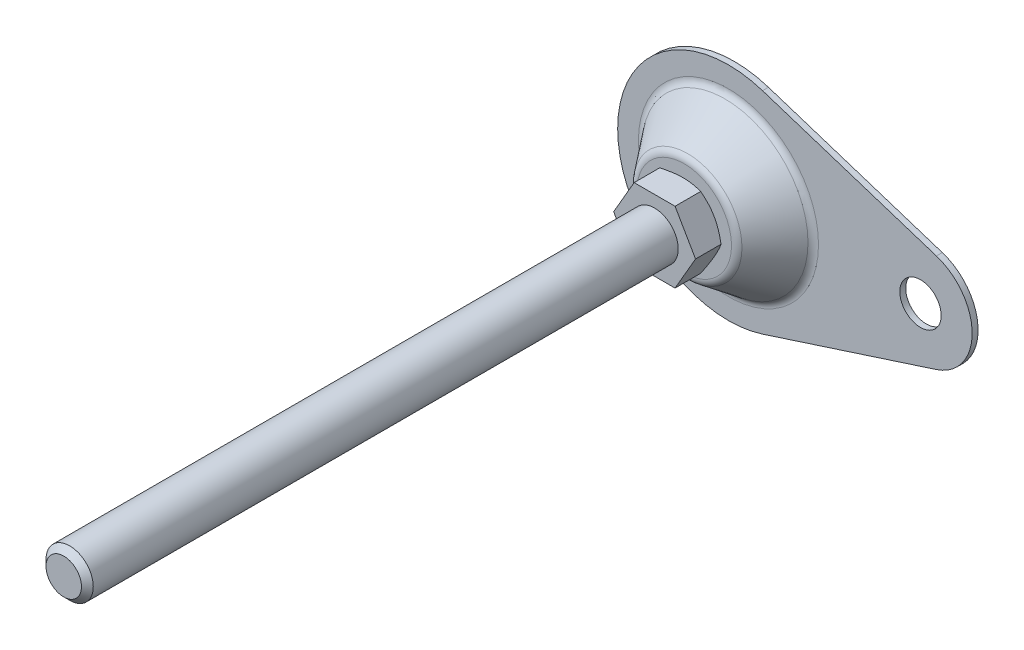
ISO-10303-21;
HEADER;
FILE_DESCRIPTION(('STEP AP214'),'2;1');
FILE_NAME('part.step','',(''),(''),'','','');
FILE_SCHEMA(('AUTOMOTIVE_DESIGN { 1 0 10303 214 1 1 1 1 }'));
ENDSEC;
DATA;
#1=APPLICATION_CONTEXT('core data for automotive mechanical design processes');
#2=APPLICATION_PROTOCOL_DEFINITION('international standard','automotive_design',2000,#1);
#3=PRODUCT_CONTEXT('',#1,'mechanical');
#4=PRODUCT('Part','Part','',(#3));
#5=PRODUCT_RELATED_PRODUCT_CATEGORY('part','',(#4));
#6=PRODUCT_DEFINITION_FORMATION('','',#4);
#7=PRODUCT_DEFINITION_CONTEXT('part definition',#1,'design');
#8=PRODUCT_DEFINITION('design','',#6,#7);
#9=PRODUCT_DEFINITION_SHAPE('','',#8);
#10=(LENGTH_UNIT() NAMED_UNIT(*) SI_UNIT(.MILLI.,.METRE.));
#11=(NAMED_UNIT(*) PLANE_ANGLE_UNIT() SI_UNIT($,.RADIAN.));
#12=(NAMED_UNIT(*) SI_UNIT($,.STERADIAN.) SOLID_ANGLE_UNIT());
#13=UNCERTAINTY_MEASURE_WITH_UNIT(LENGTH_MEASURE(1.E-05),#10,'distance_accuracy_value','');
#14=(GEOMETRIC_REPRESENTATION_CONTEXT(3) GLOBAL_UNCERTAINTY_ASSIGNED_CONTEXT((#13)) GLOBAL_UNIT_ASSIGNED_CONTEXT((#10,
#11,#12)) REPRESENTATION_CONTEXT('',''));
#15=CARTESIAN_POINT('',(0.,0.,0.));
#16=DIRECTION('',(0.,0.,1.));
#17=DIRECTION('',(1.,0.,0.));
#18=AXIS2_PLACEMENT_3D('',#15,#16,#17);
#19=CARTESIAN_POINT('',(65.,0.,2.));
#20=DIRECTION('',(0.,0.,1.));
#21=DIRECTION('',(1.,0.,0.));
#22=AXIS2_PLACEMENT_3D('',#19,#20,#21);
#23=PLANE('',#22);
#24=CARTESIAN_POINT('',(0.,0.,2.));
#25=DIRECTION('',(0.,0.,1.));
#26=DIRECTION('',(1.,0.,0.));
#27=AXIS2_PLACEMENT_3D('',#24,#25,#26);
#28=CIRCLE('',#27,30.4802116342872);
#29=CARTESIAN_POINT('',(30.4802116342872,0.,2.));
#30=VERTEX_POINT('',#29);
#31=EDGE_CURVE('E245',#30,#30,#28,.F.);
#32=ORIENTED_EDGE('',*,*,#31,.T.);
#33=EDGE_LOOP('',(#32));
#34=FACE_BOUND('',#33,.T.);
#35=CARTESIAN_POINT('',(65.,0.,2.));
#36=DIRECTION('',(0.,0.,1.));
#37=DIRECTION('',(1.,0.,0.));
#38=AXIS2_PLACEMENT_3D('',#35,#36,#37);
#39=CIRCLE('',#38,7.);
#40=CARTESIAN_POINT('',(72.,0.,2.));
#41=VERTEX_POINT('',#40);
#42=EDGE_CURVE('E262',#41,#41,#39,.T.);
#43=ORIENTED_EDGE('',*,*,#42,.F.);
#44=EDGE_LOOP('',(#43));
#45=FACE_BOUND('',#44,.T.);
#46=DIRECTION('',(-0.951485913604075,0.307692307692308,0.));
#47=VECTOR('',#46,1.);
#48=CARTESIAN_POINT('',(11.5384615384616,35.6807217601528,2.));
#49=LINE('',#48,#47);
#50=CARTESIAN_POINT('',(70.3846153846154,16.6510034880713,2.));
#51=VERTEX_POINT('',#50);
#52=CARTESIAN_POINT('',(11.5384615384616,35.6807217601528,2.));
#53=VERTEX_POINT('',#52);
#54=EDGE_CURVE('E112',#51,#53,#49,.T.);
#55=ORIENTED_EDGE('',*,*,#54,.T.);
#56=CARTESIAN_POINT('',(0.,0.,2.));
#57=DIRECTION('',(0.,0.,1.));
#58=DIRECTION('',(1.,0.,0.));
#59=AXIS2_PLACEMENT_3D('',#56,#57,#58);
#60=CIRCLE('',#59,37.5);
#61=CARTESIAN_POINT('',(11.5384615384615,-35.6807217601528,2.));
#62=VERTEX_POINT('',#61);
#63=EDGE_CURVE('E114',#53,#62,#60,.T.);
#64=ORIENTED_EDGE('',*,*,#63,.T.);
#65=DIRECTION('',(0.951485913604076,0.307692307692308,0.));
#66=VECTOR('',#65,1.);
#67=CARTESIAN_POINT('',(11.5384615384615,-35.6807217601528,2.));
#68=LINE('',#67,#66);
#69=CARTESIAN_POINT('',(70.3846153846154,-16.6510034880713,2.));
#70=VERTEX_POINT('',#69);
#71=EDGE_CURVE('E97',#62,#70,#68,.T.);
#72=ORIENTED_EDGE('',*,*,#71,.T.);
#73=CARTESIAN_POINT('',(65.,0.,2.));
#74=DIRECTION('',(0.,0.,1.));
#75=DIRECTION('',(1.,0.,0.));
#76=AXIS2_PLACEMENT_3D('',#73,#74,#75);
#77=CIRCLE('',#76,17.5);
#78=EDGE_CURVE('E106',#70,#51,#77,.T.);
#79=ORIENTED_EDGE('',*,*,#78,.T.);
#80=EDGE_LOOP('',(#55,#64,#72,#79));
#81=FACE_BOUND('',#80,.T.);
#82=ADVANCED_FACE('F14',(#34,#45,#81),#23,.T.);
#83=CARTESIAN_POINT('',(65.,0.,0.));
#84=DIRECTION('',(0.,0.,1.));
#85=DIRECTION('',(1.,0.,0.));
#86=AXIS2_PLACEMENT_3D('',#83,#84,#85);
#87=PLANE('',#86);
#88=CARTESIAN_POINT('',(65.,0.,0.));
#89=DIRECTION('',(0.,0.,1.));
#90=DIRECTION('',(1.,0.,0.));
#91=AXIS2_PLACEMENT_3D('',#88,#89,#90);
#92=CIRCLE('',#91,7.);
#93=CARTESIAN_POINT('',(72.,0.,0.));
#94=VERTEX_POINT('',#93);
#95=EDGE_CURVE('E258',#94,#94,#92,.T.);
#96=ORIENTED_EDGE('',*,*,#95,.T.);
#97=EDGE_LOOP('',(#96));
#98=FACE_BOUND('',#97,.T.);
#99=CARTESIAN_POINT('',(0.,0.,0.));
#100=DIRECTION('',(0.,0.,1.));
#101=DIRECTION('',(1.,0.,0.));
#102=AXIS2_PLACEMENT_3D('',#99,#100,#101);
#103=CIRCLE('',#102,37.5);
#104=CARTESIAN_POINT('',(11.5384615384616,35.6807217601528,0.));
#105=VERTEX_POINT('',#104);
#106=CARTESIAN_POINT('',(11.5384615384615,-35.6807217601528,0.));
#107=VERTEX_POINT('',#106);
#108=EDGE_CURVE('E275',#105,#107,#103,.T.);
#109=ORIENTED_EDGE('',*,*,#108,.F.);
#110=DIRECTION('',(-0.951485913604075,0.307692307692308,0.));
#111=VECTOR('',#110,1.);
#112=CARTESIAN_POINT('',(70.3846153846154,16.6510034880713,0.));
#113=LINE('',#112,#111);
#114=CARTESIAN_POINT('',(70.3846153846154,16.6510034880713,0.));
#115=VERTEX_POINT('',#114);
#116=EDGE_CURVE('E9',#115,#105,#113,.T.);
#117=ORIENTED_EDGE('',*,*,#116,.F.);
#118=CARTESIAN_POINT('',(65.,0.,0.));
#119=DIRECTION('',(0.,0.,1.));
#120=DIRECTION('',(1.,0.,0.));
#121=AXIS2_PLACEMENT_3D('',#118,#119,#120);
#122=CIRCLE('',#121,17.5);
#123=CARTESIAN_POINT('',(70.3846153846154,-16.6510034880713,0.));
#124=VERTEX_POINT('',#123);
#125=EDGE_CURVE('E22',#124,#115,#122,.T.);
#126=ORIENTED_EDGE('',*,*,#125,.F.);
#127=DIRECTION('',(0.951485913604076,0.307692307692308,0.));
#128=VECTOR('',#127,1.);
#129=CARTESIAN_POINT('',(70.3846153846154,-16.6510034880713,0.));
#130=LINE('',#129,#128);
#131=EDGE_CURVE('E99',#107,#124,#130,.T.);
#132=ORIENTED_EDGE('',*,*,#131,.F.);
#133=EDGE_LOOP('',(#109,#117,#126,#132));
#134=FACE_BOUND('',#133,.T.);
#135=ADVANCED_FACE('F215',(#98,#134),#87,.F.);
#136=CARTESIAN_POINT('',(0.,0.,17.));
#137=DIRECTION('',(0.,0.,-1.));
#138=DIRECTION('',(-1.,0.,0.));
#139=AXIS2_PLACEMENT_3D('',#136,#137,#138);
#140=PLANE('',#139);
#141=CARTESIAN_POINT('',(0.,0.,17.));
#142=DIRECTION('',(0.,0.,-1.));
#143=DIRECTION('',(-1.,0.,0.));
#144=AXIS2_PLACEMENT_3D('',#141,#142,#143);
#145=CIRCLE('',#144,16.0197883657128);
#146=CARTESIAN_POINT('',(-16.0197883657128,0.,17.));
#147=VERTEX_POINT('',#146);
#148=EDGE_CURVE('E278',#147,#147,#145,.F.);
#149=ORIENTED_EDGE('',*,*,#148,.T.);
#150=EDGE_LOOP('',(#149));
#151=FACE_BOUND('',#150,.T.);
#152=CARTESIAN_POINT('',(0.,0.,17.));
#153=DIRECTION('',(0.,0.,-1.));
#154=DIRECTION('',(-1.,0.,0.));
#155=AXIS2_PLACEMENT_3D('',#152,#153,#154);
#156=CIRCLE('',#155,11.5);
#157=CARTESIAN_POINT('',(-11.5,0.,17.));
#158=VERTEX_POINT('',#157);
#159=EDGE_CURVE('E122',#158,#158,#156,.T.);
#160=ORIENTED_EDGE('',*,*,#159,.T.);
#161=EDGE_LOOP('',(#160));
#162=FACE_BOUND('',#161,.T.);
#163=ADVANCED_FACE('F211',(#151,#162),#140,.F.);
#164=CARTESIAN_POINT('',(0.,0.,5.));
#165=DIRECTION('',(0.,0.,1.));
#166=DIRECTION('',(1.,0.,0.));
#167=AXIS2_PLACEMENT_3D('',#164,#165,#166);
#168=TOROIDAL_SURFACE('',#167,30.4802116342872,3.);
#169=CARTESIAN_POINT('',(0.,0.,3.1747053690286));
#170=DIRECTION('',(0.,0.,1.));
#171=DIRECTION('',(1.,0.,0.));
#172=AXIS2_PLACEMENT_3D('',#169,#170,#171);
#173=CIRCLE('',#172,28.0993925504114);
#174=CARTESIAN_POINT('',(28.0993925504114,0.,3.1747053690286));
#175=VERTEX_POINT('',#174);
#176=EDGE_CURVE('E242',#175,#175,#173,.T.);
#177=ORIENTED_EDGE('',*,*,#176,.F.);
#178=EDGE_LOOP('',(#177));
#179=FACE_BOUND('',#178,.T.);
#180=ORIENTED_EDGE('',*,*,#31,.F.);
#181=EDGE_LOOP('',(#180));
#182=FACE_BOUND('',#181,.T.);
#183=ADVANCED_FACE('F214',(#179,#182),#168,.F.);
#184=CARTESIAN_POINT('',(0.,0.,14.));
#185=DIRECTION('',(0.,0.,-1.));
#186=DIRECTION('',(-1.,0.,0.));
#187=AXIS2_PLACEMENT_3D('',#184,#185,#186);
#188=TOROIDAL_SURFACE('',#187,16.0197883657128,3.);
#189=ORIENTED_EDGE('',*,*,#148,.F.);
#190=EDGE_LOOP('',(#189));
#191=FACE_BOUND('',#190,.T.);
#192=CARTESIAN_POINT('',(0.,0.,15.8252946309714));
#193=DIRECTION('',(0.,0.,1.));
#194=DIRECTION('',(1.,0.,0.));
#195=AXIS2_PLACEMENT_3D('',#192,#193,#194);
#196=CIRCLE('',#195,18.4006074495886);
#197=CARTESIAN_POINT('',(18.4006074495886,0.,15.8252946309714));
#198=VERTEX_POINT('',#197);
#199=EDGE_CURVE('E251',#198,#198,#196,.F.);
#200=ORIENTED_EDGE('',*,*,#199,.F.);
#201=EDGE_LOOP('',(#200));
#202=FACE_BOUND('',#201,.T.);
#203=ADVANCED_FACE('F229',(#191,#202),#188,.T.);
#204=CARTESIAN_POINT('',(0.,0.,2.));
#205=DIRECTION('',(0.,0.,-1.));
#206=DIRECTION('',(-1.,0.,0.));
#207=AXIS2_PLACEMENT_3D('',#204,#205,#206);
#208=CYLINDRICAL_SURFACE('',#207,37.5);
#209=ORIENTED_EDGE('',*,*,#108,.T.);
#210=DIRECTION('',(0.,0.,1.));
#211=VECTOR('',#210,1.);
#212=CARTESIAN_POINT('',(11.5384615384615,-35.6807217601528,-8.));
#213=LINE('',#212,#211);
#214=EDGE_CURVE('E103',#107,#62,#213,.T.);
#215=ORIENTED_EDGE('',*,*,#214,.T.);
#216=ORIENTED_EDGE('',*,*,#63,.F.);
#217=DIRECTION('',(0.,0.,1.));
#218=VECTOR('',#217,1.);
#219=CARTESIAN_POINT('',(11.5384615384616,35.6807217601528,-8.));
#220=LINE('',#219,#218);
#221=EDGE_CURVE('E119',#105,#53,#220,.T.);
#222=ORIENTED_EDGE('',*,*,#221,.F.);
#223=EDGE_LOOP('',(#209,#215,#216,#222));
#224=FACE_BOUND('',#223,.T.);
#225=ADVANCED_FACE('F219',(#224),#208,.T.);
#226=CARTESIAN_POINT('',(65.,0.,2.));
#227=DIRECTION('',(0.,0.,-1.));
#228=DIRECTION('',(-1.,0.,0.));
#229=AXIS2_PLACEMENT_3D('',#226,#227,#228);
#230=CYLINDRICAL_SURFACE('',#229,7.);
#231=ORIENTED_EDGE('',*,*,#42,.T.);
#232=EDGE_LOOP('',(#231));
#233=FACE_BOUND('',#232,.T.);
#234=ORIENTED_EDGE('',*,*,#95,.F.);
#235=EDGE_LOOP('',(#234));
#236=FACE_BOUND('',#235,.T.);
#237=ADVANCED_FACE('F209',(#233,#236),#230,.F.);
#238=CARTESIAN_POINT('',(0.,0.,2.));
#239=DIRECTION('',(0.,0.,-1.));
#240=DIRECTION('',(-1.,0.,0.));
#241=AXIS2_PLACEMENT_3D('',#238,#239,#240);
#242=CONICAL_SURFACE('',#241,29.,0.654082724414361);
#243=ORIENTED_EDGE('',*,*,#176,.T.);
#244=EDGE_LOOP('',(#243));
#245=FACE_BOUND('',#244,.T.);
#246=ORIENTED_EDGE('',*,*,#199,.T.);
#247=EDGE_LOOP('',(#246));
#248=FACE_BOUND('',#247,.T.);
#249=ADVANCED_FACE('F151',(#245,#248),#242,.T.);
#250=CARTESIAN_POINT('',(0.,0.,17.));
#251=DIRECTION('',(0.,0.,1.));
#252=DIRECTION('',(1.,0.,0.));
#253=AXIS2_PLACEMENT_3D('',#250,#251,#252);
#254=CONICAL_SURFACE('',#253,11.5,1.0471975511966);
#255=ORIENTED_EDGE('',*,*,#159,.F.);
#256=EDGE_LOOP('',(#255));
#257=FACE_BOUND('',#256,.T.);
#258=CARTESIAN_POINT('',(13.8565219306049,0.000200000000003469,18.3605385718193));
#259=CARTESIAN_POINT('',(13.7042251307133,-0.263585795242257,18.2726247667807));
#260=CARTESIAN_POINT('',(13.5513604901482,-0.528355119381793,18.1887011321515));
#261=CARTESIAN_POINT('',(13.244405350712,-1.06001701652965,18.0299413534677));
#262=CARTESIAN_POINT('',(13.0903144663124,-1.32691025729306,17.9551081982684));
#263=CARTESIAN_POINT('',(12.6255589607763,-2.131890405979,17.745692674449));
#264=CARTESIAN_POINT('',(12.3130596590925,-2.67315507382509,17.6265783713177));
#265=CARTESIAN_POINT('',(11.8454187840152,-3.48313282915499,17.486906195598));
#266=CARTESIAN_POINT('',(11.6916742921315,-3.74942610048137,17.4471189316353));
#267=CARTESIAN_POINT('',(11.3834734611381,-4.28324559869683,17.3803985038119));
#268=CARTESIAN_POINT('',(11.2290171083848,-4.55077184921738,17.3534655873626));
#269=CARTESIAN_POINT('',(10.9198468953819,-5.08627036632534,17.3131437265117));
#270=CARTESIAN_POINT('',(10.7651335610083,-5.35424172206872,17.2997386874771));
#271=CARTESIAN_POINT('',(10.4555635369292,-5.89043273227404,17.286758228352));
#272=CARTESIAN_POINT('',(10.3007068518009,-6.15865237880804,17.2871823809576));
#273=CARTESIAN_POINT('',(10.0112020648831,-6.66008937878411,17.3008951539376));
#274=CARTESIAN_POINT('',(9.87653331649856,-6.89334249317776,17.3125111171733));
#275=CARTESIAN_POINT('',(9.60750555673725,-7.35931224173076,17.3459831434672));
#276=CARTESIAN_POINT('',(9.47314656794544,-7.59202883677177,17.367839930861));
#277=CARTESIAN_POINT('',(9.2048113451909,-8.05679907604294,17.4214125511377));
#278=CARTESIAN_POINT('',(9.07083551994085,-8.288852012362,17.4531365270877));
#279=CARTESIAN_POINT('',(8.80351197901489,-8.75186996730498,17.5258869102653));
#280=CARTESIAN_POINT('',(8.67016430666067,-8.98283491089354,17.566913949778));
#281=CARTESIAN_POINT('',(8.2653799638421,-9.68394195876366,17.7049867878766));
#282=CARTESIAN_POINT('',(7.99511549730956,-10.1520537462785,17.8158000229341));
#283=CARTESIAN_POINT('',(7.45861659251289,-11.0812971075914,18.0673009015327));
#284=CARTESIAN_POINT('',(7.19237528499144,-11.5424405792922,18.2079294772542));
#285=CARTESIAN_POINT('',(6.92808776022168,-12.0002,18.3605385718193));
#286=B_SPLINE_CURVE_WITH_KNOTS('',3,(#258,#259,#260,#261,#262,#263,#264,#265,#266,#267,#268,
#269,#270,#271,#272,#273,#274,#275,#276,#277,#278,#279,#280,#281,#282,#283,#284,#285),
.UNSPECIFIED.,.F.,.F.,(4,2,2,2,2,2,2,2,2,2,2,2,2,4),(0.,0.951004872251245,1.90232158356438,
3.80900466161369,4.7389455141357,5.66890426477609,6.59775529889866,7.52657763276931,
8.33514643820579,9.1437724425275,9.95306755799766,10.7624176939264,12.4167102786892,
14.0677556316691),.UNSPECIFIED.);
#287=CARTESIAN_POINT('',(13.856406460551,0.,18.3604719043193));
#288=VERTEX_POINT('',#287);
#289=CARTESIAN_POINT('',(6.92820323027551,-12.,18.3604719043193));
#290=VERTEX_POINT('',#289);
#291=EDGE_CURVE('E29',#288,#290,#286,.T.);
#292=ORIENTED_EDGE('',*,*,#291,.T.);
#293=CARTESIAN_POINT('',(-18.6410153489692,-12.,23.1600481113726));
#294=CARTESIAN_POINT('',(-18.3787899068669,-12.,23.0327508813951));
#295=CARTESIAN_POINT('',(-18.1162575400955,-12.,22.9060861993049));
#296=CARTESIAN_POINT('',(-17.5905149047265,-12.,22.654165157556));
#297=CARTESIAN_POINT('',(-17.3273046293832,-12.,22.5289088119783));
#298=CARTESIAN_POINT('',(-16.5364911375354,-12.,22.1554342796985));
#299=CARTESIAN_POINT('',(-16.0077824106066,-12.,21.9095481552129));
#300=CARTESIAN_POINT('',(-14.9439749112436,-12.,21.4241595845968));
#301=CARTESIAN_POINT('',(-14.4088570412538,-12.,21.1846988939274));
#302=CARTESIAN_POINT('',(-13.334375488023,-12.,20.7155347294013));
#303=CARTESIAN_POINT('',(-12.7950120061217,-12.,20.4858307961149));
#304=CARTESIAN_POINT('',(-11.6938395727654,-12.,20.0316084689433));
#305=CARTESIAN_POINT('',(-11.1318644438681,-12.,19.8074908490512));
#306=CARTESIAN_POINT('',(-10.0013475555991,-12.,19.3761419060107));
#307=CARTESIAN_POINT('',(-9.43280506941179,-12.,19.1689124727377));
#308=CARTESIAN_POINT('',(-8.28932063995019,-12.,18.7767590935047));
#309=CARTESIAN_POINT('',(-7.7143941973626,-12.,18.5917903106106));
#310=CARTESIAN_POINT('',(-6.55624108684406,-12.,18.2500615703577));
#311=CARTESIAN_POINT('',(-5.97301708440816,-12.,18.0932927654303));
#312=CARTESIAN_POINT('',(-5.09341880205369,-12.,17.885362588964));
#313=CARTESIAN_POINT('',(-4.80021092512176,-12.,17.8207256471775));
#314=CARTESIAN_POINT('',(-4.21178591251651,-12.,17.7013001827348));
#315=CARTESIAN_POINT('',(-3.91656881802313,-12.,17.6465114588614));
#316=CARTESIAN_POINT('',(-3.32432767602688,-12.,17.5477478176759));
#317=CARTESIAN_POINT('',(-3.02730366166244,-12.,17.5037727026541));
#318=CARTESIAN_POINT('',(-2.43175994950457,-12.,17.4275121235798));
#319=CARTESIAN_POINT('',(-2.13324031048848,-12.,17.3952262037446));
#320=CARTESIAN_POINT('',(-1.539036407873,-12.,17.3433921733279));
#321=CARTESIAN_POINT('',(-1.24336632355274,-12.,17.3236825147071));
#322=CARTESIAN_POINT('',(-0.651458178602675,-12.,17.2967859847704));
#323=CARTESIAN_POINT('',(-0.355220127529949,-12.,17.2895989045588));
#324=CARTESIAN_POINT('',(0.23729768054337,-12.,17.2879186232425));
#325=CARTESIAN_POINT('',(0.533577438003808,-12.,17.2934255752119));
#326=CARTESIAN_POINT('',(1.12564027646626,-12.,17.3169987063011));
#327=CARTESIAN_POINT('',(1.42142333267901,-12.,17.3350654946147));
#328=CARTESIAN_POINT('',(2.13118105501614,-12.,17.3931048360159));
#329=CARTESIAN_POINT('',(2.54468368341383,-12.,17.4389751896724));
#330=CARTESIAN_POINT('',(3.36862223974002,-12.,17.5527684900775));
#331=CARTESIAN_POINT('',(3.7790577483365,-12.,17.6206943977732));
#332=CARTESIAN_POINT('',(5.00527964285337,-12.,17.8539535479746));
#333=CARTESIAN_POINT('',(5.81553985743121,-12.,18.0487273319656));
#334=CARTESIAN_POINT('',(7.02745571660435,-12.,18.3865960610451));
#335=CARTESIAN_POINT('',(7.43538920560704,-12.,18.5084672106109));
#336=CARTESIAN_POINT('',(8.24729253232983,-12.,18.7648833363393));
#337=CARTESIAN_POINT('',(8.65126234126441,-12.,18.8994284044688));
#338=CARTESIAN_POINT('',(9.45536949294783,-12.,19.1790317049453));
#339=CARTESIAN_POINT('',(9.85550801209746,-12.,19.3240865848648));
#340=CARTESIAN_POINT('',(10.6524640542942,-12.,19.6230007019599));
#341=CARTESIAN_POINT('',(11.0492816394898,-12.,19.7768597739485));
#342=CARTESIAN_POINT('',(12.0758114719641,-12.,20.1858825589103));
#343=CARTESIAN_POINT('',(12.703256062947,-12.,20.4467306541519));
#344=CARTESIAN_POINT('',(13.952098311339,-12.,20.9825682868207));
#345=CARTESIAN_POINT('',(14.5734954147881,-12.,21.2575591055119));
#346=CARTESIAN_POINT('',(15.8115551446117,-12.,21.8184832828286));
#347=CARTESIAN_POINT('',(16.4282161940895,-12.,22.1044201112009));
#348=CARTESIAN_POINT('',(17.6575144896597,-12.,22.6847395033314));
#349=CARTESIAN_POINT('',(18.2701518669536,-12.,22.9791217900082));
#350=CARTESIAN_POINT('',(19.4930206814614,-12.,23.5749867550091));
#351=CARTESIAN_POINT('',(20.1032475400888,-12.,23.8764788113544));
#352=CARTESIAN_POINT('',(21.3210192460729,-12.,24.4848332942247));
#353=CARTESIAN_POINT('',(21.9285640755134,-12.,24.7916957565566));
#354=CARTESIAN_POINT('',(23.1413221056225,-12.,25.4097197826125));
#355=CARTESIAN_POINT('',(23.7465357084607,-12.,25.7208805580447));
#356=CARTESIAN_POINT('',(24.9551061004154,-12.,26.3467797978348));
#357=CARTESIAN_POINT('',(25.5584628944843,-12.,26.66151825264));
#358=CARTESIAN_POINT('',(27.2474276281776,-12.,27.5478348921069));
#359=CARTESIAN_POINT('',(28.3312903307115,-12.,28.1227382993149));
#360=CARTESIAN_POINT('',(30.4953173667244,-12.,29.2795803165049));
#361=CARTESIAN_POINT('',(31.5754815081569,-12.,29.8615192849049));
#362=CARTESIAN_POINT('',(33.7297154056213,-12.,31.028935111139));
#363=CARTESIAN_POINT('',(34.8037937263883,-12.,31.6143961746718));
#364=CARTESIAN_POINT('',(36.413207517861,-12.,32.4956091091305));
#365=CARTESIAN_POINT('',(36.949376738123,-12.,32.789840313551));
#366=CARTESIAN_POINT('',(38.0212177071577,-12.,33.3792058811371));
#367=CARTESIAN_POINT('',(38.5568894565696,-12.,33.6743402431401));
#368=CARTESIAN_POINT('',(39.0923422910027,-12.,33.9698713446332));
#369=B_SPLINE_CURVE_WITH_KNOTS('',3,(#293,#294,#295,#296,#297,#298,#299,#300,#301,#302,#303,
#304,#305,#306,#307,#308,#309,#310,#311,#312,#313,#314,#315,#316,#317,#318,#319,#320,#321,#322,
#323,#324,#325,#326,#327,#328,#329,#330,#331,#332,#333,#334,#335,#336,#337,#338,#339,#340,#341,
#342,#343,#344,#345,#346,#347,#348,#349,#350,#351,#352,#353,#354,#355,#356,#357,#358,#359,#360,
#361,#362,#363,#364,#365,#366,#367,#368),.UNSPECIFIED.,.F.,.F.,(4,2,2,2,2,2,2,2,2,2,2,2,2,2,2,2,
2,2,2,2,2,2,2,2,2,2,2,2,2,2,2,2,2,2,2,2,2,4),(0.,0.87447021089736,1.74894915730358,
3.49816446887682,5.2568475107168,7.01544764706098,8.83028936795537,10.6453339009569,
12.4566591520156,14.2674151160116,15.1680201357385,16.068606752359,16.9691769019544,
17.8697119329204,18.7584330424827,19.6471393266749,20.5358563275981,21.4246164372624,
22.6720299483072,23.9196109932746,26.4160973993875,27.6932374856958,28.9703868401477,
30.2471305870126,31.5238503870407,33.5621163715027,35.6005673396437,37.6396699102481,
39.6787056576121,41.7206007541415,43.7625094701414,45.8040485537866,47.8455821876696,
51.5262282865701,55.2070626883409,58.876884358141,60.7116711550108,62.5464555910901),.UNSPECIFIED.);
#370=CARTESIAN_POINT('',(-6.92820323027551,-12.,18.3604719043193));
#371=VERTEX_POINT('',#370);
#372=EDGE_CURVE('E158',#290,#371,#369,.F.);
#373=ORIENTED_EDGE('',*,*,#372,.T.);
#374=CARTESIAN_POINT('',(-6.92808776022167,-12.0002,18.3605385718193));
#375=CARTESIAN_POINT('',(-7.08038456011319,-11.7364142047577,18.2726247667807));
#376=CARTESIAN_POINT('',(-7.23324920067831,-11.4716448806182,18.1887011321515));
#377=CARTESIAN_POINT('',(-7.5402043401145,-10.9399829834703,18.0299413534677));
#378=CARTESIAN_POINT('',(-7.69429522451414,-10.6730897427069,17.9551081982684));
#379=CARTESIAN_POINT('',(-8.15905073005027,-9.868109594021,17.745692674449));
#380=CARTESIAN_POINT('',(-8.47155003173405,-9.32684492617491,17.6265783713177));
#381=CARTESIAN_POINT('',(-8.93919090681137,-8.51686717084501,17.486906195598));
#382=CARTESIAN_POINT('',(-9.09293539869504,-8.25057389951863,17.4471189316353));
#383=CARTESIAN_POINT('',(-9.40113622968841,-7.71675440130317,17.3803985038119));
#384=CARTESIAN_POINT('',(-9.55559258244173,-7.44922815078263,17.3534655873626));
#385=CARTESIAN_POINT('',(-9.86476279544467,-6.91372963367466,17.3131437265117));
#386=CARTESIAN_POINT('',(-10.0194761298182,-6.64575827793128,17.2997386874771));
#387=CARTESIAN_POINT('',(-10.3290461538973,-6.10956726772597,17.286758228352));
#388=CARTESIAN_POINT('',(-10.4839028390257,-5.84134762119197,17.2871823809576));
#389=CARTESIAN_POINT('',(-10.7734076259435,-5.3399106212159,17.3008951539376));
#390=CARTESIAN_POINT('',(-10.908076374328,-5.10665750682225,17.3125111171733));
#391=CARTESIAN_POINT('',(-11.1771041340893,-4.64068775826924,17.3459831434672));
#392=CARTESIAN_POINT('',(-11.3114631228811,-4.40797116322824,17.367839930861));
#393=CARTESIAN_POINT('',(-11.5797983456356,-3.94320092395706,17.4214125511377));
#394=CARTESIAN_POINT('',(-11.7137741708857,-3.711147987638,17.4531365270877));
#395=CARTESIAN_POINT('',(-11.9810977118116,-3.24813003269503,17.5258869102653));
#396=CARTESIAN_POINT('',(-12.1144453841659,-3.01716508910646,17.566913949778));
#397=CARTESIAN_POINT('',(-12.5192297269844,-2.31605804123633,17.7049867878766));
#398=CARTESIAN_POINT('',(-12.789494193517,-1.84794625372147,17.8158000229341));
#399=CARTESIAN_POINT('',(-13.3259930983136,-0.91870289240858,18.0673009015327));
#400=CARTESIAN_POINT('',(-13.5922344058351,-0.457559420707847,18.2079294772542));
#401=CARTESIAN_POINT('',(-13.8565219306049,0.000199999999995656,18.3605385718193));
#402=B_SPLINE_CURVE_WITH_KNOTS('',3,(#374,#375,#376,#377,#378,#379,#380,#381,#382,#383,#384,
#385,#386,#387,#388,#389,#390,#391,#392,#393,#394,#395,#396,#397,#398,#399,#400,#401),
.UNSPECIFIED.,.F.,.F.,(4,2,2,2,2,2,2,2,2,2,2,2,2,4),(0.,0.951004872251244,1.90232158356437,
3.80900466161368,4.7389455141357,5.66890426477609,6.59775529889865,7.5265776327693,
8.33514643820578,9.14377244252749,9.95306755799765,10.7624176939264,12.4167102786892,
14.0677556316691),.UNSPECIFIED.);
#403=CARTESIAN_POINT('',(-13.856406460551,0.,18.3604719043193));
#404=VERTEX_POINT('',#403);
#405=EDGE_CURVE('E127',#371,#404,#402,.T.);
#406=ORIENTED_EDGE('',*,*,#405,.T.);
#407=CARTESIAN_POINT('',(-13.8565219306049,-0.000200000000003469,18.3605385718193));
#408=CARTESIAN_POINT('',(-13.7042251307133,0.26358579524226,18.2726247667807));
#409=CARTESIAN_POINT('',(-13.5513604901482,0.528355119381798,18.1887011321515));
#410=CARTESIAN_POINT('',(-13.244405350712,1.06001701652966,18.0299413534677));
#411=CARTESIAN_POINT('',(-13.0903144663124,1.32691025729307,17.9551081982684));
#412=CARTESIAN_POINT('',(-12.6255589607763,2.13189040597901,17.745692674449));
#413=CARTESIAN_POINT('',(-12.3130596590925,2.6731550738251,17.6265783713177));
#414=CARTESIAN_POINT('',(-11.8454187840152,3.483132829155,17.486906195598));
#415=CARTESIAN_POINT('',(-11.6916742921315,3.74942610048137,17.4471189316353));
#416=CARTESIAN_POINT('',(-11.3834734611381,4.28324559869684,17.3803985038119));
#417=CARTESIAN_POINT('',(-11.2290171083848,4.55077184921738,17.3534655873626));
#418=CARTESIAN_POINT('',(-10.9198468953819,5.08627036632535,17.3131437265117));
#419=CARTESIAN_POINT('',(-10.7651335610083,5.35424172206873,17.2997386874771));
#420=CARTESIAN_POINT('',(-10.4555635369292,5.89043273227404,17.286758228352));
#421=CARTESIAN_POINT('',(-10.3007068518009,6.15865237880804,17.2871823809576));
#422=CARTESIAN_POINT('',(-10.0112020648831,6.66008937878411,17.3008951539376));
#423=CARTESIAN_POINT('',(-9.87653331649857,6.89334249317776,17.3125111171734));
#424=CARTESIAN_POINT('',(-9.60750555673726,7.35931224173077,17.3459831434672));
#425=CARTESIAN_POINT('',(-9.47314656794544,7.59202883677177,17.367839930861));
#426=CARTESIAN_POINT('',(-9.20481134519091,8.05679907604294,17.4214125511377));
#427=CARTESIAN_POINT('',(-9.07083551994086,8.288852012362,17.4531365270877));
#428=CARTESIAN_POINT('',(-8.8035119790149,8.75186996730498,17.5258869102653));
#429=CARTESIAN_POINT('',(-8.67016430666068,8.98283491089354,17.566913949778));
#430=CARTESIAN_POINT('',(-8.26537996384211,9.68394195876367,17.7049867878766));
#431=CARTESIAN_POINT('',(-7.99511549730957,10.1520537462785,17.8158000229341));
#432=CARTESIAN_POINT('',(-7.4586165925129,11.0812971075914,18.0673009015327));
#433=CARTESIAN_POINT('',(-7.19237528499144,11.5424405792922,18.2079294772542));
#434=CARTESIAN_POINT('',(-6.92808776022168,12.0002,18.3605385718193));
#435=B_SPLINE_CURVE_WITH_KNOTS('',3,(#407,#408,#409,#410,#411,#412,#413,#414,#415,#416,#417,
#418,#419,#420,#421,#422,#423,#424,#425,#426,#427,#428,#429,#430,#431,#432,#433,#434),
.UNSPECIFIED.,.F.,.F.,(4,2,2,2,2,2,2,2,2,2,2,2,2,4),(0.,0.951004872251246,1.90232158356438,
3.80900466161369,4.7389455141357,5.66890426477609,6.59775529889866,7.52657763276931,
8.33514643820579,9.14377244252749,9.95306755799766,10.7624176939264,12.4167102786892,
14.0677556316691),.UNSPECIFIED.);
#436=CARTESIAN_POINT('',(-6.92820323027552,12.,18.3604719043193));
#437=VERTEX_POINT('',#436);
#438=EDGE_CURVE('E135',#404,#437,#435,.T.);
#439=ORIENTED_EDGE('',*,*,#438,.T.);
#440=CARTESIAN_POINT('',(-18.6410153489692,12.,23.1600481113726));
#441=CARTESIAN_POINT('',(-18.3787899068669,12.,23.0327508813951));
#442=CARTESIAN_POINT('',(-18.1162575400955,12.,22.9060861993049));
#443=CARTESIAN_POINT('',(-17.5905149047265,12.,22.654165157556));
#444=CARTESIAN_POINT('',(-17.3273046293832,12.,22.5289088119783));
#445=CARTESIAN_POINT('',(-16.5364911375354,12.,22.1554342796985));
#446=CARTESIAN_POINT('',(-16.0077824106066,12.,21.9095481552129));
#447=CARTESIAN_POINT('',(-14.9439749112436,12.,21.4241595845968));
#448=CARTESIAN_POINT('',(-14.4088570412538,12.,21.1846988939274));
#449=CARTESIAN_POINT('',(-13.334375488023,12.,20.7155347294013));
#450=CARTESIAN_POINT('',(-12.7950120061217,12.,20.4858307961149));
#451=CARTESIAN_POINT('',(-11.6938395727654,12.,20.0316084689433));
#452=CARTESIAN_POINT('',(-11.1318644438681,12.,19.8074908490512));
#453=CARTESIAN_POINT('',(-10.0013475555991,12.,19.3761419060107));
#454=CARTESIAN_POINT('',(-9.43280506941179,12.,19.1689124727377));
#455=CARTESIAN_POINT('',(-8.2893206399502,12.,18.7767590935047));
#456=CARTESIAN_POINT('',(-7.7143941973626,12.,18.5917903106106));
#457=CARTESIAN_POINT('',(-6.55624108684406,12.,18.2500615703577));
#458=CARTESIAN_POINT('',(-5.97301708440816,12.,18.0932927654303));
#459=CARTESIAN_POINT('',(-5.09341880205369,12.,17.885362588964));
#460=CARTESIAN_POINT('',(-4.80021092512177,12.,17.8207256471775));
#461=CARTESIAN_POINT('',(-4.21178591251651,12.,17.7013001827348));
#462=CARTESIAN_POINT('',(-3.91656881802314,12.,17.6465114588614));
#463=CARTESIAN_POINT('',(-3.32432767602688,12.,17.5477478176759));
#464=CARTESIAN_POINT('',(-3.02730366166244,12.,17.5037727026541));
#465=CARTESIAN_POINT('',(-2.43175994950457,12.,17.4275121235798));
#466=CARTESIAN_POINT('',(-2.13324031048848,12.,17.3952262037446));
#467=CARTESIAN_POINT('',(-1.53903640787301,12.,17.3433921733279));
#468=CARTESIAN_POINT('',(-1.24336632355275,12.,17.3236825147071));
#469=CARTESIAN_POINT('',(-0.651458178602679,12.,17.2967859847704));
#470=CARTESIAN_POINT('',(-0.355220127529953,12.,17.2895989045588));
#471=CARTESIAN_POINT('',(0.237297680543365,12.,17.2879186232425));
#472=CARTESIAN_POINT('',(0.533577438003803,12.,17.2934255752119));
#473=CARTESIAN_POINT('',(1.12564027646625,12.,17.3169987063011));
#474=CARTESIAN_POINT('',(1.42142333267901,12.,17.3350654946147));
#475=CARTESIAN_POINT('',(2.13118105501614,12.,17.3931048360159));
#476=CARTESIAN_POINT('',(2.54468368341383,12.,17.4389751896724));
#477=CARTESIAN_POINT('',(3.36862223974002,12.,17.5527684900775));
#478=CARTESIAN_POINT('',(3.77905774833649,12.,17.6206943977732));
#479=CARTESIAN_POINT('',(5.00527964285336,12.,17.8539535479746));
#480=CARTESIAN_POINT('',(5.8155398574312,12.,18.0487273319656));
#481=CARTESIAN_POINT('',(7.02745571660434,12.,18.3865960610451));
#482=CARTESIAN_POINT('',(7.43538920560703,12.,18.5084672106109));
#483=CARTESIAN_POINT('',(8.24729253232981,12.,18.7648833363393));
#484=CARTESIAN_POINT('',(8.6512623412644,12.,18.8994284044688));
#485=CARTESIAN_POINT('',(9.45536949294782,12.,19.1790317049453));
#486=CARTESIAN_POINT('',(9.85550801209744,12.,19.3240865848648));
#487=CARTESIAN_POINT('',(10.6524640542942,12.,19.6230007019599));
#488=CARTESIAN_POINT('',(11.0492816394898,12.,19.7768597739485));
#489=CARTESIAN_POINT('',(12.0758114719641,12.,20.1858825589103));
#490=CARTESIAN_POINT('',(12.703256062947,12.,20.4467306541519));
#491=CARTESIAN_POINT('',(13.9520983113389,12.,20.9825682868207));
#492=CARTESIAN_POINT('',(14.5734954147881,12.,21.2575591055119));
#493=CARTESIAN_POINT('',(15.8115551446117,12.,21.8184832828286));
#494=CARTESIAN_POINT('',(16.4282161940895,12.,22.1044201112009));
#495=CARTESIAN_POINT('',(17.6575144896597,12.,22.6847395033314));
#496=CARTESIAN_POINT('',(18.2701518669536,12.,22.9791217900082));
#497=CARTESIAN_POINT('',(19.4930206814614,12.,23.5749867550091));
#498=CARTESIAN_POINT('',(20.1032475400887,12.,23.8764788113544));
#499=CARTESIAN_POINT('',(21.3210192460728,12.,24.4848332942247));
#500=CARTESIAN_POINT('',(21.9285640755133,12.,24.7916957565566));
#501=CARTESIAN_POINT('',(23.1413221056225,12.,25.4097197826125));
#502=CARTESIAN_POINT('',(23.7465357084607,12.,25.7208805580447));
#503=CARTESIAN_POINT('',(24.9551061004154,12.,26.3467797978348));
#504=CARTESIAN_POINT('',(25.5584628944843,12.,26.66151825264));
#505=CARTESIAN_POINT('',(27.2474276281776,12.,27.5478348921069));
#506=CARTESIAN_POINT('',(28.3312903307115,12.,28.1227382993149));
#507=CARTESIAN_POINT('',(30.4953173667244,12.,29.2795803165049));
#508=CARTESIAN_POINT('',(31.5754815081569,12.,29.8615192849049));
#509=CARTESIAN_POINT('',(33.7297154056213,12.,31.0289351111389));
#510=CARTESIAN_POINT('',(34.8037937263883,12.,31.6143961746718));
#511=CARTESIAN_POINT('',(36.413207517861,12.,32.4956091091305));
#512=CARTESIAN_POINT('',(36.949376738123,12.,32.789840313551));
#513=CARTESIAN_POINT('',(38.0212177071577,12.,33.3792058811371));
#514=CARTESIAN_POINT('',(38.5568894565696,12.,33.6743402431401));
#515=CARTESIAN_POINT('',(39.0923422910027,12.,33.9698713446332));
#516=B_SPLINE_CURVE_WITH_KNOTS('',3,(#440,#441,#442,#443,#444,#445,#446,#447,#448,#449,#450,
#451,#452,#453,#454,#455,#456,#457,#458,#459,#460,#461,#462,#463,#464,#465,#466,#467,#468,#469,
#470,#471,#472,#473,#474,#475,#476,#477,#478,#479,#480,#481,#482,#483,#484,#485,#486,#487,#488,
#489,#490,#491,#492,#493,#494,#495,#496,#497,#498,#499,#500,#501,#502,#503,#504,#505,#506,#507,
#508,#509,#510,#511,#512,#513,#514,#515),.UNSPECIFIED.,.F.,.F.,(4,2,2,2,2,2,2,2,2,2,2,2,2,2,2,2,
2,2,2,2,2,2,2,2,2,2,2,2,2,2,2,2,2,2,2,2,2,4),(0.,0.874470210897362,1.74894915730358,
3.49816446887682,5.2568475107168,7.01544764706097,8.83028936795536,10.6453339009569,
12.4566591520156,14.2674151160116,15.1680201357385,16.068606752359,16.9691769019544,
17.8697119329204,18.7584330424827,19.6471393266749,20.5358563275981,21.4246164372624,
22.6720299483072,23.9196109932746,26.4160973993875,27.6932374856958,28.9703868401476,
30.2471305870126,31.5238503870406,33.5621163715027,35.6005673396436,37.6396699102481,
39.6787056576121,41.7206007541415,43.7625094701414,45.8040485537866,47.8455821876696,
51.52622828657,55.2070626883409,58.876884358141,60.7116711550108,62.5464555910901),.UNSPECIFIED.);
#517=CARTESIAN_POINT('',(6.92820323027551,12.,18.3604719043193));
#518=VERTEX_POINT('',#517);
#519=EDGE_CURVE('E169',#437,#518,#516,.T.);
#520=ORIENTED_EDGE('',*,*,#519,.T.);
#521=CARTESIAN_POINT('',(6.92808776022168,12.0002,18.3605385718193));
#522=CARTESIAN_POINT('',(7.0803845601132,11.7364142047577,18.2726247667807));
#523=CARTESIAN_POINT('',(7.23324920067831,11.4716448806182,18.1887011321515));
#524=CARTESIAN_POINT('',(7.5402043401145,10.9399829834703,18.0299413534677));
#525=CARTESIAN_POINT('',(7.69429522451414,10.6730897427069,17.9551081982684));
#526=CARTESIAN_POINT('',(8.15905073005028,9.86810959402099,17.745692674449));
#527=CARTESIAN_POINT('',(8.47155003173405,9.3268449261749,17.6265783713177));
#528=CARTESIAN_POINT('',(8.93919090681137,8.51686717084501,17.486906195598));
#529=CARTESIAN_POINT('',(9.09293539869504,8.25057389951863,17.4471189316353));
#530=CARTESIAN_POINT('',(9.40113622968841,7.71675440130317,17.3803985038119));
#531=CARTESIAN_POINT('',(9.55559258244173,7.44922815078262,17.3534655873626));
#532=CARTESIAN_POINT('',(9.86476279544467,6.91372963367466,17.3131437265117));
#533=CARTESIAN_POINT('',(10.0194761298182,6.64575827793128,17.2997386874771));
#534=CARTESIAN_POINT('',(10.3290461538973,6.10956726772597,17.286758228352));
#535=CARTESIAN_POINT('',(10.4839028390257,5.84134762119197,17.2871823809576));
#536=CARTESIAN_POINT('',(10.7734076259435,5.3399106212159,17.3008951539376));
#537=CARTESIAN_POINT('',(10.908076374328,5.10665750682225,17.3125111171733));
#538=CARTESIAN_POINT('',(11.1771041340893,4.64068775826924,17.3459831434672));
#539=CARTESIAN_POINT('',(11.3114631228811,4.40797116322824,17.367839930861));
#540=CARTESIAN_POINT('',(11.5797983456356,3.94320092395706,17.4214125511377));
#541=CARTESIAN_POINT('',(11.7137741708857,3.711147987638,17.4531365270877));
#542=CARTESIAN_POINT('',(11.9810977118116,3.24813003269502,17.5258869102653));
#543=CARTESIAN_POINT('',(12.1144453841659,3.01716508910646,17.566913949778));
#544=CARTESIAN_POINT('',(12.5192297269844,2.31605804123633,17.7049867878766));
#545=CARTESIAN_POINT('',(12.789494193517,1.84794625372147,17.8158000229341));
#546=CARTESIAN_POINT('',(13.3259930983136,0.91870289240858,18.0673009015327));
#547=CARTESIAN_POINT('',(13.5922344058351,0.457559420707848,18.2079294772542));
#548=CARTESIAN_POINT('',(13.8565219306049,-0.00019999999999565,18.3605385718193));
#549=B_SPLINE_CURVE_WITH_KNOTS('',3,(#521,#522,#523,#524,#525,#526,#527,#528,#529,#530,#531,
#532,#533,#534,#535,#536,#537,#538,#539,#540,#541,#542,#543,#544,#545,#546,#547,#548),
.UNSPECIFIED.,.F.,.F.,(4,2,2,2,2,2,2,2,2,2,2,2,2,4),(0.,0.951004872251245,1.90232158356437,
3.80900466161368,4.7389455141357,5.66890426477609,6.59775529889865,7.52657763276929,
8.33514643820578,9.14377244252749,9.95306755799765,10.7624176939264,12.4167102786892,
14.0677556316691),.UNSPECIFIED.);
#550=EDGE_CURVE('E176',#518,#288,#549,.T.);
#551=ORIENTED_EDGE('',*,*,#550,.T.);
#552=EDGE_LOOP('',(#292,#373,#406,#439,#520,#551));
#553=FACE_BOUND('',#552,.T.);
#554=ADVANCED_FACE('F145',(#257,#553),#254,.T.);
#555=CARTESIAN_POINT('',(0.,0.,227.));
#556=DIRECTION('',(0.,0.,1.));
#557=DIRECTION('',(1.,0.,0.));
#558=AXIS2_PLACEMENT_3D('',#555,#556,#557);
#559=PLANE('',#558);
#560=CARTESIAN_POINT('',(0.,0.,227.));
#561=DIRECTION('',(0.,0.,1.));
#562=DIRECTION('',(1.,0.,0.));
#563=AXIS2_PLACEMENT_3D('',#560,#561,#562);
#564=CIRCLE('',#563,6.);
#565=CARTESIAN_POINT('',(6.,0.,227.));
#566=VERTEX_POINT('',#565);
#567=EDGE_CURVE('E246',#566,#566,#564,.T.);
#568=ORIENTED_EDGE('',*,*,#567,.T.);
#569=EDGE_LOOP('',(#568));
#570=FACE_BOUND('',#569,.T.);
#571=ADVANCED_FACE('F150',(#570),#559,.T.);
#572=CARTESIAN_POINT('',(0.,0.,227.));
#573=DIRECTION('',(0.,0.,-1.));
#574=DIRECTION('',(-1.,0.,0.));
#575=AXIS2_PLACEMENT_3D('',#572,#573,#574);
#576=CONICAL_SURFACE('',#575,6.,0.785398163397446);
#577=CARTESIAN_POINT('',(0.,0.,225.));
#578=DIRECTION('',(0.,0.,1.));
#579=DIRECTION('',(1.,0.,0.));
#580=AXIS2_PLACEMENT_3D('',#577,#578,#579);
#581=CIRCLE('',#580,8.);
#582=CARTESIAN_POINT('',(8.,0.,225.));
#583=VERTEX_POINT('',#582);
#584=EDGE_CURVE('E249',#583,#583,#581,.F.);
#585=ORIENTED_EDGE('',*,*,#584,.F.);
#586=EDGE_LOOP('',(#585));
#587=FACE_BOUND('',#586,.T.);
#588=ORIENTED_EDGE('',*,*,#567,.F.);
#589=EDGE_LOOP('',(#588));
#590=FACE_BOUND('',#589,.T.);
#591=ADVANCED_FACE('F16',(#587,#590),#576,.T.);
#592=CARTESIAN_POINT('',(0.,0.,227.));
#593=DIRECTION('',(0.,0.,-1.));
#594=DIRECTION('',(-1.,0.,0.));
#595=AXIS2_PLACEMENT_3D('',#592,#593,#594);
#596=CYLINDRICAL_SURFACE('',#595,8.);
#597=CARTESIAN_POINT('',(0.,0.,27.));
#598=DIRECTION('',(0.,0.,1.));
#599=DIRECTION('',(1.,0.,0.));
#600=AXIS2_PLACEMENT_3D('',#597,#598,#599);
#601=CIRCLE('',#600,8.);
#602=CARTESIAN_POINT('',(8.,0.,27.));
#603=VERTEX_POINT('',#602);
#604=EDGE_CURVE('E256',#603,#603,#601,.T.);
#605=ORIENTED_EDGE('',*,*,#604,.T.);
#606=EDGE_LOOP('',(#605));
#607=FACE_BOUND('',#606,.T.);
#608=ORIENTED_EDGE('',*,*,#584,.T.);
#609=EDGE_LOOP('',(#608));
#610=FACE_BOUND('',#609,.T.);
#611=ADVANCED_FACE('F203',(#607,#610),#596,.T.);
#612=CARTESIAN_POINT('',(0.,0.,27.));
#613=DIRECTION('',(0.,0.,1.));
#614=DIRECTION('',(1.,0.,0.));
#615=AXIS2_PLACEMENT_3D('',#612,#613,#614);
#616=PLANE('',#615);
#617=DIRECTION('',(0.5,0.866025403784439,0.));
#618=VECTOR('',#617,1.);
#619=CARTESIAN_POINT('',(6.92820323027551,-12.,27.));
#620=LINE('',#619,#618);
#621=CARTESIAN_POINT('',(6.92820323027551,-12.,27.));
#622=VERTEX_POINT('',#621);
#623=CARTESIAN_POINT('',(13.856406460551,0.,27.));
#624=VERTEX_POINT('',#623);
#625=EDGE_CURVE('E321',#622,#624,#620,.T.);
#626=ORIENTED_EDGE('',*,*,#625,.T.);
#627=DIRECTION('',(-0.5,0.866025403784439,0.));
#628=VECTOR('',#627,1.);
#629=CARTESIAN_POINT('',(13.856406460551,0.,27.));
#630=LINE('',#629,#628);
#631=CARTESIAN_POINT('',(6.92820323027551,12.,27.));
#632=VERTEX_POINT('',#631);
#633=EDGE_CURVE('E320',#624,#632,#630,.T.);
#634=ORIENTED_EDGE('',*,*,#633,.T.);
#635=DIRECTION('',(-1.,0.,0.));
#636=VECTOR('',#635,1.);
#637=CARTESIAN_POINT('',(6.92820323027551,12.,27.));
#638=LINE('',#637,#636);
#639=CARTESIAN_POINT('',(-6.92820323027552,12.,27.));
#640=VERTEX_POINT('',#639);
#641=EDGE_CURVE('E318',#632,#640,#638,.T.);
#642=ORIENTED_EDGE('',*,*,#641,.T.);
#643=DIRECTION('',(-0.5,-0.866025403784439,0.));
#644=VECTOR('',#643,1.);
#645=CARTESIAN_POINT('',(-6.92820323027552,12.,27.));
#646=LINE('',#645,#644);
#647=CARTESIAN_POINT('',(-13.856406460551,0.,27.));
#648=VERTEX_POINT('',#647);
#649=EDGE_CURVE('E314',#640,#648,#646,.T.);
#650=ORIENTED_EDGE('',*,*,#649,.T.);
#651=DIRECTION('',(0.5,-0.866025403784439,0.));
#652=VECTOR('',#651,1.);
#653=CARTESIAN_POINT('',(-13.856406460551,0.,27.));
#654=LINE('',#653,#652);
#655=CARTESIAN_POINT('',(-6.92820323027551,-12.,27.));
#656=VERTEX_POINT('',#655);
#657=EDGE_CURVE('E328',#648,#656,#654,.T.);
#658=ORIENTED_EDGE('',*,*,#657,.T.);
#659=DIRECTION('',(1.,0.,0.));
#660=VECTOR('',#659,1.);
#661=CARTESIAN_POINT('',(-6.92820323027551,-12.,27.));
#662=LINE('',#661,#660);
#663=EDGE_CURVE('E37',#656,#622,#662,.T.);
#664=ORIENTED_EDGE('',*,*,#663,.T.);
#665=EDGE_LOOP('',(#626,#634,#642,#650,#658,#664));
#666=FACE_BOUND('',#665,.T.);
#667=ORIENTED_EDGE('',*,*,#604,.F.);
#668=EDGE_LOOP('',(#667));
#669=FACE_BOUND('',#668,.T.);
#670=ADVANCED_FACE('F154',(#666,#669),#616,.T.);
#671=CARTESIAN_POINT('',(-6.92820323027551,-12.,27.));
#672=DIRECTION('',(0.,1.,0.));
#673=DIRECTION('',(0.,0.,1.));
#674=AXIS2_PLACEMENT_3D('',#671,#672,#673);
#675=PLANE('',#674);
#676=ORIENTED_EDGE('',*,*,#372,.F.);
#677=DIRECTION('',(0.,0.,-1.));
#678=VECTOR('',#677,1.);
#679=CARTESIAN_POINT('',(6.92820323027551,-12.,27.));
#680=LINE('',#679,#678);
#681=EDGE_CURVE('E304',#622,#290,#680,.T.);
#682=ORIENTED_EDGE('',*,*,#681,.F.);
#683=ORIENTED_EDGE('',*,*,#663,.F.);
#684=DIRECTION('',(0.,0.,-1.));
#685=VECTOR('',#684,1.);
#686=CARTESIAN_POINT('',(-6.92820323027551,-12.,27.));
#687=LINE('',#686,#685);
#688=EDGE_CURVE('E300',#656,#371,#687,.T.);
#689=ORIENTED_EDGE('',*,*,#688,.T.);
#690=EDGE_LOOP('',(#676,#682,#683,#689));
#691=FACE_BOUND('',#690,.T.);
#692=ADVANCED_FACE('F303',(#691),#675,.F.);
#693=CARTESIAN_POINT('',(-13.856406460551,0.,27.));
#694=DIRECTION('',(0.866025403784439,0.5,0.));
#695=DIRECTION('',(-0.5,0.866025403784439,0.));
#696=AXIS2_PLACEMENT_3D('',#693,#694,#695);
#697=PLANE('',#696);
#698=ORIENTED_EDGE('',*,*,#405,.F.);
#699=ORIENTED_EDGE('',*,*,#688,.F.);
#700=ORIENTED_EDGE('',*,*,#657,.F.);
#701=DIRECTION('',(0.,0.,-1.));
#702=VECTOR('',#701,1.);
#703=CARTESIAN_POINT('',(-13.856406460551,0.,27.));
#704=LINE('',#703,#702);
#705=EDGE_CURVE('E302',#648,#404,#704,.T.);
#706=ORIENTED_EDGE('',*,*,#705,.T.);
#707=EDGE_LOOP('',(#698,#699,#700,#706));
#708=FACE_BOUND('',#707,.T.);
#709=ADVANCED_FACE('F142',(#708),#697,.F.);
#710=CARTESIAN_POINT('',(-6.92820323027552,12.,27.));
#711=DIRECTION('',(0.866025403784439,-0.5,0.));
#712=DIRECTION('',(0.5,0.866025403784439,0.));
#713=AXIS2_PLACEMENT_3D('',#710,#711,#712);
#714=PLANE('',#713);
#715=ORIENTED_EDGE('',*,*,#438,.F.);
#716=ORIENTED_EDGE('',*,*,#705,.F.);
#717=ORIENTED_EDGE('',*,*,#649,.F.);
#718=DIRECTION('',(0.,0.,-1.));
#719=VECTOR('',#718,1.);
#720=CARTESIAN_POINT('',(-6.92820323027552,12.,27.));
#721=LINE('',#720,#719);
#722=EDGE_CURVE('E270',#640,#437,#721,.T.);
#723=ORIENTED_EDGE('',*,*,#722,.T.);
#724=EDGE_LOOP('',(#715,#716,#717,#723));
#725=FACE_BOUND('',#724,.T.);
#726=ADVANCED_FACE('F313',(#725),#714,.F.);
#727=CARTESIAN_POINT('',(6.92820323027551,12.,27.));
#728=DIRECTION('',(0.,-1.,0.));
#729=DIRECTION('',(1.,0.,0.));
#730=AXIS2_PLACEMENT_3D('',#727,#728,#729);
#731=PLANE('',#730);
#732=ORIENTED_EDGE('',*,*,#519,.F.);
#733=ORIENTED_EDGE('',*,*,#722,.F.);
#734=ORIENTED_EDGE('',*,*,#641,.F.);
#735=DIRECTION('',(0.,0.,-1.));
#736=VECTOR('',#735,1.);
#737=CARTESIAN_POINT('',(6.92820323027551,12.,27.));
#738=LINE('',#737,#736);
#739=EDGE_CURVE('E265',#632,#518,#738,.T.);
#740=ORIENTED_EDGE('',*,*,#739,.T.);
#741=EDGE_LOOP('',(#732,#733,#734,#740));
#742=FACE_BOUND('',#741,.T.);
#743=ADVANCED_FACE('F192',(#742),#731,.F.);
#744=CARTESIAN_POINT('',(13.856406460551,0.,27.));
#745=DIRECTION('',(-0.866025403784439,-0.5,0.));
#746=DIRECTION('',(0.5,-0.866025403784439,0.));
#747=AXIS2_PLACEMENT_3D('',#744,#745,#746);
#748=PLANE('',#747);
#749=ORIENTED_EDGE('',*,*,#550,.F.);
#750=ORIENTED_EDGE('',*,*,#739,.F.);
#751=ORIENTED_EDGE('',*,*,#633,.F.);
#752=DIRECTION('',(0.,0.,-1.));
#753=VECTOR('',#752,1.);
#754=CARTESIAN_POINT('',(13.856406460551,0.,27.));
#755=LINE('',#754,#753);
#756=EDGE_CURVE('E259',#624,#288,#755,.T.);
#757=ORIENTED_EDGE('',*,*,#756,.T.);
#758=EDGE_LOOP('',(#749,#750,#751,#757));
#759=FACE_BOUND('',#758,.T.);
#760=ADVANCED_FACE('F188',(#759),#748,.F.);
#761=CARTESIAN_POINT('',(6.92820323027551,-12.,27.));
#762=DIRECTION('',(-0.866025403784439,0.5,0.));
#763=DIRECTION('',(-0.5,-0.866025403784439,0.));
#764=AXIS2_PLACEMENT_3D('',#761,#762,#763);
#765=PLANE('',#764);
#766=ORIENTED_EDGE('',*,*,#291,.F.);
#767=ORIENTED_EDGE('',*,*,#756,.F.);
#768=ORIENTED_EDGE('',*,*,#625,.F.);
#769=ORIENTED_EDGE('',*,*,#681,.T.);
#770=EDGE_LOOP('',(#766,#767,#768,#769));
#771=FACE_BOUND('',#770,.T.);
#772=ADVANCED_FACE('F191',(#771),#765,.F.);
#773=CARTESIAN_POINT('',(11.5384615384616,35.6807217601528,-8.));
#774=DIRECTION('',(0.307692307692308,0.951485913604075,0.));
#775=DIRECTION('',(-0.951485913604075,0.307692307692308,0.));
#776=AXIS2_PLACEMENT_3D('',#773,#774,#775);
#777=PLANE('',#776);
#778=ORIENTED_EDGE('',*,*,#116,.T.);
#779=ORIENTED_EDGE('',*,*,#221,.T.);
#780=ORIENTED_EDGE('',*,*,#54,.F.);
#781=DIRECTION('',(0.,0.,1.));
#782=VECTOR('',#781,1.);
#783=CARTESIAN_POINT('',(70.3846153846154,16.6510034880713,-8.));
#784=LINE('',#783,#782);
#785=EDGE_CURVE('E102',#115,#51,#784,.T.);
#786=ORIENTED_EDGE('',*,*,#785,.F.);
#787=EDGE_LOOP('',(#778,#779,#780,#786));
#788=FACE_BOUND('',#787,.T.);
#789=ADVANCED_FACE('F198',(#788),#777,.T.);
#790=CARTESIAN_POINT('',(65.,0.,-8.));
#791=DIRECTION('',(0.,0.,1.));
#792=DIRECTION('',(1.,0.,0.));
#793=AXIS2_PLACEMENT_3D('',#790,#791,#792);
#794=CYLINDRICAL_SURFACE('',#793,17.5);
#795=ORIENTED_EDGE('',*,*,#125,.T.);
#796=ORIENTED_EDGE('',*,*,#785,.T.);
#797=ORIENTED_EDGE('',*,*,#78,.F.);
#798=DIRECTION('',(0.,0.,1.));
#799=VECTOR('',#798,1.);
#800=CARTESIAN_POINT('',(70.3846153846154,-16.6510034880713,-8.));
#801=LINE('',#800,#799);
#802=EDGE_CURVE('E92',#124,#70,#801,.T.);
#803=ORIENTED_EDGE('',*,*,#802,.F.);
#804=EDGE_LOOP('',(#795,#796,#797,#803));
#805=FACE_BOUND('',#804,.T.);
#806=ADVANCED_FACE('F107',(#805),#794,.T.);
#807=CARTESIAN_POINT('',(11.5384615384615,-35.6807217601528,-8.));
#808=DIRECTION('',(0.307692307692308,-0.951485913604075,0.));
#809=DIRECTION('',(0.951485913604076,0.307692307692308,0.));
#810=AXIS2_PLACEMENT_3D('',#807,#808,#809);
#811=PLANE('',#810);
#812=ORIENTED_EDGE('',*,*,#131,.T.);
#813=ORIENTED_EDGE('',*,*,#802,.T.);
#814=ORIENTED_EDGE('',*,*,#71,.F.);
#815=ORIENTED_EDGE('',*,*,#214,.F.);
#816=EDGE_LOOP('',(#812,#813,#814,#815));
#817=FACE_BOUND('',#816,.T.);
#818=ADVANCED_FACE('F94',(#817),#811,.T.);
#819=CLOSED_SHELL('',(#82,#135,#163,#183,#203,#225,#237,#249,#554,#571,#591,#611,#670,#692,#709,
#726,#743,#760,#772,#789,#806,#818));
#820=MANIFOLD_SOLID_BREP('B1',#819);
#821=ADVANCED_BREP_SHAPE_REPRESENTATION('',(#18,#820),#14);
#822=SHAPE_DEFINITION_REPRESENTATION(#9,#821);
ENDSEC;
END-ISO-10303-21;
